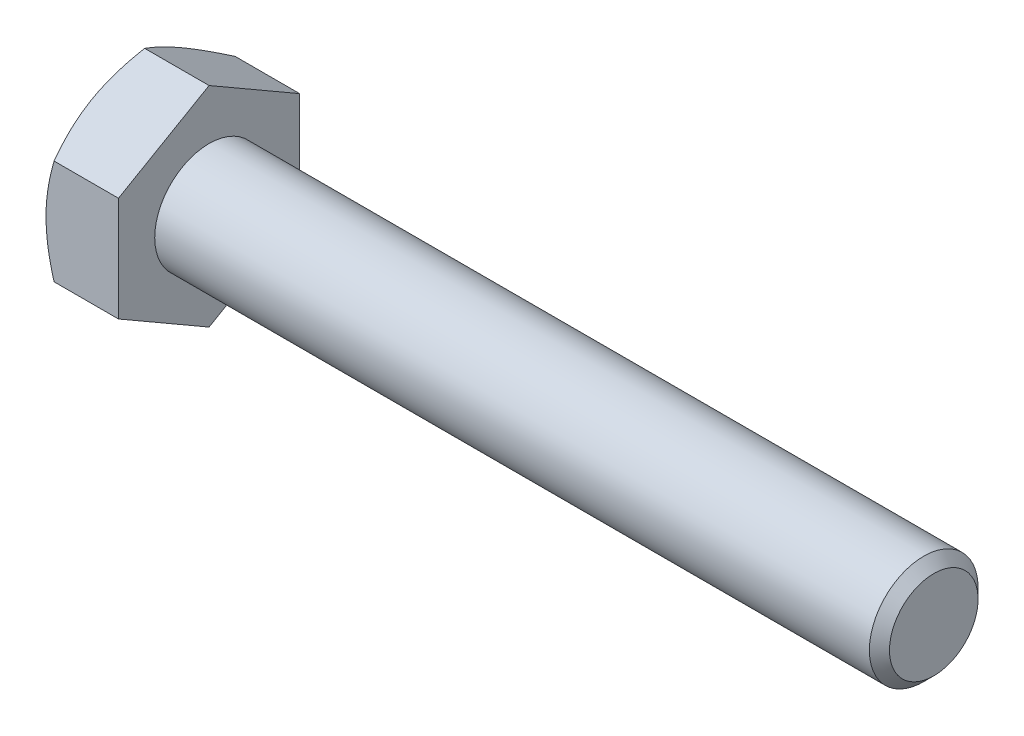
from build123d import *

# Parameters (mm, degrees)
BASEHEAD_DEPTH = 4


with BuildPart() as part:
    # Sketch1 → BaseHead (new body)
    with BuildSketch(Plane(origin=(0, 0, 0), x_dir=(0, 0, -1), z_dir=(1, 0, 0))):
        Polygon((5, 2.886751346), (5, -2.886751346), (0, -5.773502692), (-5, -2.886751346), (-5, 2.886751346), (0, 5.773502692), align=None)
    extrude(amount=BASEHEAD_DEPTH)

    # BodySke → BaseBody (revolve)
    with BuildSketch(Plane.XY, mode=Mode.PRIVATE) as basebody_sk:
        Polygon((0, 0), (44, 0), (44, 2.4455), (43.4455, 3), (0, 3), align=None)
    revolve(basebody_sk.sketch.rotate(Axis((0, 0, 0), (1, 0, 0)), 90), axis=Axis((0, 0, 0), (1, 0, 0)))

    # Sketch3 → HeadChamfer (revolve, cut)
    with BuildSketch(Plane.XY):
        Polygon((0, 5), (3.333333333, 10.773502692), (3.333333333, 15.773502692), (-10, 15.773502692), (-10, 5), align=None)
    revolve(axis=Axis((0, 0, 0), (1, 0, 0)), mode=Mode.SUBTRACT)


solid = part.part
